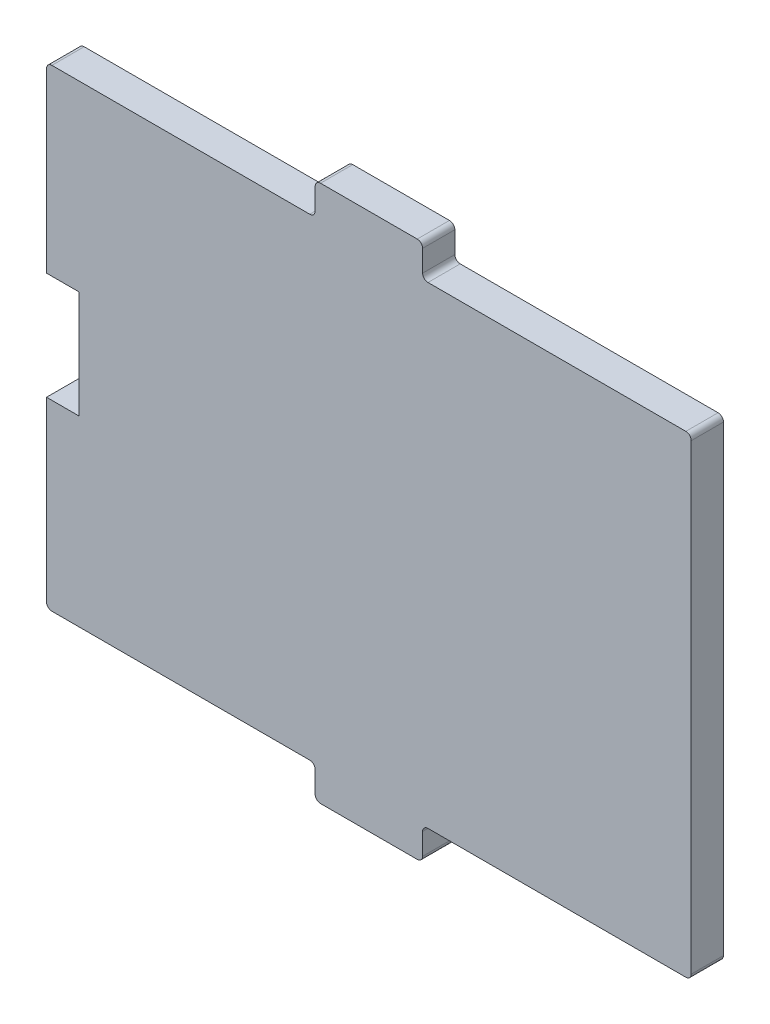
from build123d import *

# Parameters (mm, degrees)
BOSS_EXTRUDE1_DEPTH = 6
FILLET1_R           = 1
SKETCH2_W           = 6
SKETCH2_H           = 20
CUT_EXTRUDE1_DEPTH  = 117.773284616


with BuildPart() as part:
    # Sketch1 → Boss-Extrude1 (new body)
    with BuildSketch(Plane.XY):
        Polygon((-10, 0), (10, 0), (10, 6), (60, 6), (60, 94), (10, 94), (10, 100), (-10, 100), (-10, 94), (-60, 94), (-60, 6), (-10, 6), align=None)
    extrude(amount=BOSS_EXTRUDE1_DEPTH)

    # Fillet1
    fillet1_edges = [part.edges().sort_by_distance(p)[0] for p in [
        (60, 94, 3),
        (60, 6, 3),
        (10, 6, 3),
        (10, 0, 3),
        (-10, 0, 3),
        (-10, 6, 3),
        (-60, 6, 3),
        (-60, 94, 3),
        (-10, 94, 3),
        (-10, 100, 3),
        (10, 100, 3),
        (10, 94, 3),
    ]]
    fillet(fillet1_edges, radius=FILLET1_R)

    # Sketch2 → Cut-Extrude1 (cut, through all)
    with BuildSketch(Plane(origin=(0, 0, 0), x_dir=(-1, 0, 0), z_dir=(0, 0, -1))):
        with Locations((57, 50)):
            Rectangle(SKETCH2_W, SKETCH2_H)
    extrude(amount=-CUT_EXTRUDE1_DEPTH, mode=Mode.SUBTRACT)


solid = part.part
